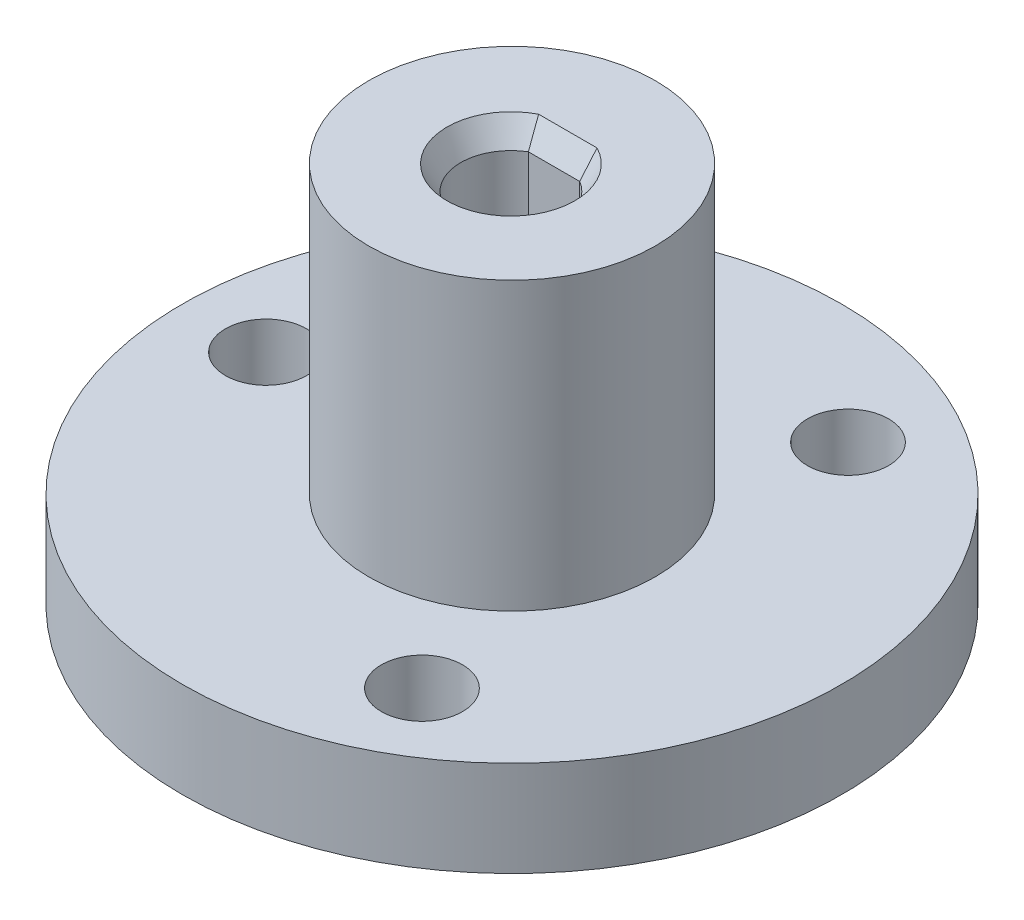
ISO-10303-21;
HEADER;
FILE_DESCRIPTION(('STEP AP214'),'2;1');
FILE_NAME('part.step','',(''),(''),'','','');
FILE_SCHEMA(('AUTOMOTIVE_DESIGN { 1 0 10303 214 1 1 1 1 }'));
ENDSEC;
DATA;
#1=APPLICATION_CONTEXT('core data for automotive mechanical design processes');
#2=APPLICATION_PROTOCOL_DEFINITION('international standard','automotive_design',2000,#1);
#3=PRODUCT_CONTEXT('',#1,'mechanical');
#4=PRODUCT('Part','Part','',(#3));
#5=PRODUCT_RELATED_PRODUCT_CATEGORY('part','',(#4));
#6=PRODUCT_DEFINITION_FORMATION('','',#4);
#7=PRODUCT_DEFINITION_CONTEXT('part definition',#1,'design');
#8=PRODUCT_DEFINITION('design','',#6,#7);
#9=PRODUCT_DEFINITION_SHAPE('','',#8);
#10=(LENGTH_UNIT() NAMED_UNIT(*) SI_UNIT(.MILLI.,.METRE.));
#11=(NAMED_UNIT(*) PLANE_ANGLE_UNIT() SI_UNIT($,.RADIAN.));
#12=(NAMED_UNIT(*) SI_UNIT($,.STERADIAN.) SOLID_ANGLE_UNIT());
#13=UNCERTAINTY_MEASURE_WITH_UNIT(LENGTH_MEASURE(1.E-05),#10,'distance_accuracy_value','');
#14=(GEOMETRIC_REPRESENTATION_CONTEXT(3) GLOBAL_UNCERTAINTY_ASSIGNED_CONTEXT((#13)) GLOBAL_UNIT_ASSIGNED_CONTEXT((#10,
#11,#12)) REPRESENTATION_CONTEXT('',''));
#15=CARTESIAN_POINT('',(0.,0.,0.));
#16=DIRECTION('',(0.,0.,1.));
#17=DIRECTION('',(1.,0.,0.));
#18=AXIS2_PLACEMENT_3D('',#15,#16,#17);
#19=CARTESIAN_POINT('',(-10.3,4.,0.));
#20=DIRECTION('',(0.,-1.,0.));
#21=DIRECTION('',(0.,0.,-1.));
#22=AXIS2_PLACEMENT_3D('',#19,#20,#21);
#23=CYLINDRICAL_SURFACE('',#22,1.7);
#24=CARTESIAN_POINT('',(-10.3,4.,0.));
#25=DIRECTION('',(0.,1.,0.));
#26=DIRECTION('',(0.,0.,1.));
#27=AXIS2_PLACEMENT_3D('',#24,#25,#26);
#28=CIRCLE('',#27,1.7);
#29=CARTESIAN_POINT('',(-10.3,4.,1.7));
#30=VERTEX_POINT('',#29);
#31=EDGE_CURVE('E118',#30,#30,#28,.T.);
#32=ORIENTED_EDGE('',*,*,#31,.T.);
#33=EDGE_LOOP('',(#32));
#34=FACE_BOUND('',#33,.T.);
#35=CARTESIAN_POINT('',(-10.3,0.,0.));
#36=DIRECTION('',(0.,1.,0.));
#37=DIRECTION('',(0.,0.,1.));
#38=AXIS2_PLACEMENT_3D('',#35,#36,#37);
#39=CIRCLE('',#38,1.7);
#40=CARTESIAN_POINT('',(-10.3,0.,1.7));
#41=VERTEX_POINT('',#40);
#42=EDGE_CURVE('E133',#41,#41,#39,.T.);
#43=ORIENTED_EDGE('',*,*,#42,.F.);
#44=EDGE_LOOP('',(#43));
#45=FACE_BOUND('',#44,.T.);
#46=ADVANCED_FACE('F45',(#34,#45),#23,.F.);
#47=CARTESIAN_POINT('',(5.15,4.,-8.92006165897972));
#48=DIRECTION('',(0.,-1.,0.));
#49=DIRECTION('',(0.,0.,-1.));
#50=AXIS2_PLACEMENT_3D('',#47,#48,#49);
#51=CYLINDRICAL_SURFACE('',#50,1.7);
#52=CARTESIAN_POINT('',(5.15,4.,-8.92006165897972));
#53=DIRECTION('',(0.,1.,0.));
#54=DIRECTION('',(0.,0.,1.));
#55=AXIS2_PLACEMENT_3D('',#52,#53,#54);
#56=CIRCLE('',#55,1.7);
#57=CARTESIAN_POINT('',(5.15,4.,-7.22006165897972));
#58=VERTEX_POINT('',#57);
#59=EDGE_CURVE('E114',#58,#58,#56,.T.);
#60=ORIENTED_EDGE('',*,*,#59,.T.);
#61=EDGE_LOOP('',(#60));
#62=FACE_BOUND('',#61,.T.);
#63=CARTESIAN_POINT('',(5.15,0.,-8.92006165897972));
#64=DIRECTION('',(0.,1.,0.));
#65=DIRECTION('',(0.,0.,1.));
#66=AXIS2_PLACEMENT_3D('',#63,#64,#65);
#67=CIRCLE('',#66,1.7);
#68=CARTESIAN_POINT('',(5.15,0.,-7.22006165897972));
#69=VERTEX_POINT('',#68);
#70=EDGE_CURVE('E130',#69,#69,#67,.T.);
#71=ORIENTED_EDGE('',*,*,#70,.F.);
#72=EDGE_LOOP('',(#71));
#73=FACE_BOUND('',#72,.T.);
#74=ADVANCED_FACE('F156',(#62,#73),#51,.F.);
#75=CARTESIAN_POINT('',(5.15000000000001,4.,8.92006165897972));
#76=DIRECTION('',(0.,-1.,0.));
#77=DIRECTION('',(0.,0.,-1.));
#78=AXIS2_PLACEMENT_3D('',#75,#76,#77);
#79=CYLINDRICAL_SURFACE('',#78,1.7);
#80=CARTESIAN_POINT('',(5.15000000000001,4.,8.92006165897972));
#81=DIRECTION('',(0.,1.,0.));
#82=DIRECTION('',(0.,0.,1.));
#83=AXIS2_PLACEMENT_3D('',#80,#81,#82);
#84=CIRCLE('',#83,1.7);
#85=CARTESIAN_POINT('',(5.15000000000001,4.,10.6200616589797));
#86=VERTEX_POINT('',#85);
#87=EDGE_CURVE('E111',#86,#86,#84,.T.);
#88=ORIENTED_EDGE('',*,*,#87,.T.);
#89=EDGE_LOOP('',(#88));
#90=FACE_BOUND('',#89,.T.);
#91=CARTESIAN_POINT('',(5.15000000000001,0.,8.92006165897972));
#92=DIRECTION('',(0.,1.,0.));
#93=DIRECTION('',(0.,0.,1.));
#94=AXIS2_PLACEMENT_3D('',#91,#92,#93);
#95=CIRCLE('',#94,1.7);
#96=CARTESIAN_POINT('',(5.15000000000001,0.,10.6200616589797));
#97=VERTEX_POINT('',#96);
#98=EDGE_CURVE('E97',#97,#97,#95,.T.);
#99=ORIENTED_EDGE('',*,*,#98,.F.);
#100=EDGE_LOOP('',(#99));
#101=FACE_BOUND('',#100,.T.);
#102=ADVANCED_FACE('F151',(#90,#101),#79,.F.);
#103=CARTESIAN_POINT('',(0.,4.,0.));
#104=DIRECTION('',(0.,-1.,0.));
#105=DIRECTION('',(0.,0.,-1.));
#106=AXIS2_PLACEMENT_3D('',#103,#104,#105);
#107=CYLINDRICAL_SURFACE('',#106,13.8);
#108=CARTESIAN_POINT('',(0.,4.,0.));
#109=DIRECTION('',(0.,1.,0.));
#110=DIRECTION('',(0.,0.,1.));
#111=AXIS2_PLACEMENT_3D('',#108,#109,#110);
#112=CIRCLE('',#111,13.8);
#113=CARTESIAN_POINT('',(0.,4.,13.8));
#114=VERTEX_POINT('',#113);
#115=EDGE_CURVE('E124',#114,#114,#112,.T.);
#116=ORIENTED_EDGE('',*,*,#115,.F.);
#117=EDGE_LOOP('',(#116));
#118=FACE_BOUND('',#117,.T.);
#119=CARTESIAN_POINT('',(0.,0.,0.));
#120=DIRECTION('',(0.,1.,0.));
#121=DIRECTION('',(0.,0.,1.));
#122=AXIS2_PLACEMENT_3D('',#119,#120,#121);
#123=CIRCLE('',#122,13.8);
#124=CARTESIAN_POINT('',(0.,0.,13.8));
#125=VERTEX_POINT('',#124);
#126=EDGE_CURVE('E115',#125,#125,#123,.T.);
#127=ORIENTED_EDGE('',*,*,#126,.T.);
#128=EDGE_LOOP('',(#127));
#129=FACE_BOUND('',#128,.T.);
#130=ADVANCED_FACE('F155',(#118,#129),#107,.T.);
#131=CARTESIAN_POINT('',(0.,4.,0.));
#132=DIRECTION('',(0.,1.,0.));
#133=DIRECTION('',(0.,0.,1.));
#134=AXIS2_PLACEMENT_3D('',#131,#132,#133);
#135=PLANE('',#134);
#136=ORIENTED_EDGE('',*,*,#87,.F.);
#137=EDGE_LOOP('',(#136));
#138=FACE_BOUND('',#137,.T.);
#139=ORIENTED_EDGE('',*,*,#59,.F.);
#140=EDGE_LOOP('',(#139));
#141=FACE_BOUND('',#140,.T.);
#142=ORIENTED_EDGE('',*,*,#31,.F.);
#143=EDGE_LOOP('',(#142));
#144=FACE_BOUND('',#143,.T.);
#145=CARTESIAN_POINT('',(0.,4.,0.));
#146=DIRECTION('',(0.,1.,0.));
#147=DIRECTION('',(0.,0.,1.));
#148=AXIS2_PLACEMENT_3D('',#145,#146,#147);
#149=CIRCLE('',#148,6.);
#150=CARTESIAN_POINT('',(0.,4.,6.));
#151=VERTEX_POINT('',#150);
#152=EDGE_CURVE('E121',#151,#151,#149,.T.);
#153=ORIENTED_EDGE('',*,*,#152,.F.);
#154=EDGE_LOOP('',(#153));
#155=FACE_BOUND('',#154,.T.);
#156=ORIENTED_EDGE('',*,*,#115,.T.);
#157=EDGE_LOOP('',(#156));
#158=FACE_BOUND('',#157,.T.);
#159=ADVANCED_FACE('F166',(#138,#141,#144,#155,#158),#135,.T.);
#160=CARTESIAN_POINT('',(0.,0.,0.));
#161=DIRECTION('',(0.,1.,0.));
#162=DIRECTION('',(0.,0.,1.));
#163=AXIS2_PLACEMENT_3D('',#160,#161,#162);
#164=PLANE('',#163);
#165=ORIENTED_EDGE('',*,*,#98,.T.);
#166=EDGE_LOOP('',(#165));
#167=FACE_BOUND('',#166,.T.);
#168=ORIENTED_EDGE('',*,*,#70,.T.);
#169=EDGE_LOOP('',(#168));
#170=FACE_BOUND('',#169,.T.);
#171=ORIENTED_EDGE('',*,*,#42,.T.);
#172=EDGE_LOOP('',(#171));
#173=FACE_BOUND('',#172,.T.);
#174=ORIENTED_EDGE('',*,*,#126,.F.);
#175=EDGE_LOOP('',(#174));
#176=FACE_BOUND('',#175,.T.);
#177=CARTESIAN_POINT('',(0.,0.,0.045));
#178=DIRECTION('',(0.,1.,0.));
#179=DIRECTION('',(0.,0.,1.));
#180=AXIS2_PLACEMENT_3D('',#177,#178,#179);
#181=CIRCLE('',#180,2.1);
#182=CARTESIAN_POINT('',(-1.07330098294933,0.,-1.76));
#183=VERTEX_POINT('',#182);
#184=CARTESIAN_POINT('',(1.07330098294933,0.,-1.76));
#185=VERTEX_POINT('',#184);
#186=EDGE_CURVE('E102',#183,#185,#181,.T.);
#187=ORIENTED_EDGE('',*,*,#186,.T.);
#188=DIRECTION('',(1.,0.,0.));
#189=VECTOR('',#188,1.);
#190=CARTESIAN_POINT('',(0.,0.,-1.76));
#191=LINE('',#190,#189);
#192=EDGE_CURVE('E91',#183,#185,#191,.T.);
#193=ORIENTED_EDGE('',*,*,#192,.F.);
#194=EDGE_LOOP('',(#187,#193));
#195=FACE_BOUND('',#194,.T.);
#196=ADVANCED_FACE('F101',(#167,#170,#173,#176,#195),#164,.F.);
#197=CARTESIAN_POINT('',(0.,16.,0.045));
#198=DIRECTION('',(0.,-1.,0.));
#199=DIRECTION('',(0.,0.,-1.));
#200=AXIS2_PLACEMENT_3D('',#197,#198,#199);
#201=CYLINDRICAL_SURFACE('',#200,2.1);
#202=DIRECTION('',(0.,-1.,0.));
#203=VECTOR('',#202,1.);
#204=CARTESIAN_POINT('',(-1.07330098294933,16.,-1.76));
#205=LINE('',#204,#203);
#206=CARTESIAN_POINT('',(-1.07330098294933,15.,-1.76));
#207=VERTEX_POINT('',#206);
#208=EDGE_CURVE('E87',#207,#183,#205,.T.);
#209=ORIENTED_EDGE('',*,*,#208,.F.);
#210=CARTESIAN_POINT('',(0.,15.,0.045));
#211=DIRECTION('',(0.,1.,0.));
#212=DIRECTION('',(0.,0.,1.));
#213=AXIS2_PLACEMENT_3D('',#210,#211,#212);
#214=CIRCLE('',#213,2.1);
#215=CARTESIAN_POINT('',(1.07330098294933,15.,-1.76));
#216=VERTEX_POINT('',#215);
#217=EDGE_CURVE('E127',#207,#216,#214,.T.);
#218=ORIENTED_EDGE('',*,*,#217,.T.);
#219=DIRECTION('',(0.,-1.,0.));
#220=VECTOR('',#219,1.);
#221=CARTESIAN_POINT('',(1.07330098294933,16.,-1.76));
#222=LINE('',#221,#220);
#223=EDGE_CURVE('E98',#216,#185,#222,.T.);
#224=ORIENTED_EDGE('',*,*,#223,.T.);
#225=ORIENTED_EDGE('',*,*,#186,.F.);
#226=EDGE_LOOP('',(#209,#218,#224,#225));
#227=FACE_BOUND('',#226,.T.);
#228=ADVANCED_FACE('F105',(#227),#201,.F.);
#229=CARTESIAN_POINT('',(0.,16.,-1.76));
#230=DIRECTION('',(0.,0.,-1.));
#231=DIRECTION('',(-1.,0.,0.));
#232=AXIS2_PLACEMENT_3D('',#229,#230,#231);
#233=PLANE('',#232);
#234=ORIENTED_EDGE('',*,*,#223,.F.);
#235=DIRECTION('',(-1.,0.,0.));
#236=VECTOR('',#235,1.);
#237=CARTESIAN_POINT('',(-1.07330098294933,15.,-1.76));
#238=LINE('',#237,#236);
#239=EDGE_CURVE('E11',#216,#207,#238,.T.);
#240=ORIENTED_EDGE('',*,*,#239,.T.);
#241=ORIENTED_EDGE('',*,*,#208,.T.);
#242=ORIENTED_EDGE('',*,*,#192,.T.);
#243=EDGE_LOOP('',(#234,#240,#241,#242));
#244=FACE_BOUND('',#243,.T.);
#245=ADVANCED_FACE('F90',(#244),#233,.F.);
#246=CARTESIAN_POINT('',(0.,16.,0.));
#247=DIRECTION('',(0.,-1.,0.));
#248=DIRECTION('',(0.,0.,-1.));
#249=AXIS2_PLACEMENT_3D('',#246,#247,#248);
#250=CYLINDRICAL_SURFACE('',#249,6.);
#251=ORIENTED_EDGE('',*,*,#152,.T.);
#252=EDGE_LOOP('',(#251));
#253=FACE_BOUND('',#252,.T.);
#254=CARTESIAN_POINT('',(0.,16.,0.));
#255=DIRECTION('',(0.,1.,0.));
#256=DIRECTION('',(0.,0.,1.));
#257=AXIS2_PLACEMENT_3D('',#254,#255,#256);
#258=CIRCLE('',#257,6.);
#259=CARTESIAN_POINT('',(0.,16.,6.));
#260=VERTEX_POINT('',#259);
#261=EDGE_CURVE('E103',#260,#260,#258,.T.);
#262=ORIENTED_EDGE('',*,*,#261,.F.);
#263=EDGE_LOOP('',(#262));
#264=FACE_BOUND('',#263,.T.);
#265=ADVANCED_FACE('F178',(#253,#264),#250,.T.);
#266=CARTESIAN_POINT('',(0.,16.,0.));
#267=DIRECTION('',(0.,1.,0.));
#268=DIRECTION('',(0.,0.,1.));
#269=AXIS2_PLACEMENT_3D('',#266,#267,#268);
#270=PLANE('',#269);
#271=DIRECTION('',(1.,0.,0.));
#272=VECTOR('',#271,1.);
#273=CARTESIAN_POINT('',(1.07330098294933,16.,-2.33735026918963));
#274=LINE('',#273,#272);
#275=CARTESIAN_POINT('',(-1.22172487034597,16.,-2.33735026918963));
#276=VERTEX_POINT('',#275);
#277=CARTESIAN_POINT('',(1.22172487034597,16.,-2.33735026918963));
#278=VERTEX_POINT('',#277);
#279=EDGE_CURVE('E67',#276,#278,#274,.T.);
#280=ORIENTED_EDGE('',*,*,#279,.T.);
#281=CARTESIAN_POINT('',(0.,16.,0.045));
#282=DIRECTION('',(0.,1.,0.));
#283=DIRECTION('',(0.,0.,1.));
#284=AXIS2_PLACEMENT_3D('',#281,#282,#283);
#285=CIRCLE('',#284,2.67735026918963);
#286=EDGE_CURVE('E60',#278,#276,#285,.F.);
#287=ORIENTED_EDGE('',*,*,#286,.T.);
#288=EDGE_LOOP('',(#280,#287));
#289=FACE_BOUND('',#288,.T.);
#290=ORIENTED_EDGE('',*,*,#261,.T.);
#291=EDGE_LOOP('',(#290));
#292=FACE_BOUND('',#291,.T.);
#293=ADVANCED_FACE('F181',(#289,#292),#270,.T.);
#294=CARTESIAN_POINT('',(0.,16.,-2.33735026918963));
#295=DIRECTION('',(0.,0.499999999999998,0.86602540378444));
#296=DIRECTION('',(-1.,0.,0.));
#297=AXIS2_PLACEMENT_3D('',#294,#295,#296);
#298=PLANE('',#297);
#299=CARTESIAN_POINT('',(1.07330098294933,15.,-1.76));
#300=CARTESIAN_POINT('',(1.08650853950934,15.0832387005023,-1.80805788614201));
#301=CARTESIAN_POINT('',(1.09947933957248,15.1665053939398,-1.85613193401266));
#302=CARTESIAN_POINT('',(1.12498890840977,15.3330870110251,-1.95230787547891));
#303=CARTESIAN_POINT('',(1.13752768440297,15.4164019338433,-2.00040976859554));
#304=CARTESIAN_POINT('',(1.16221506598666,15.5830746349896,-2.09663829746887));
#305=CARTESIAN_POINT('',(1.1743636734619,15.6664324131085,-2.14476493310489));
#306=CARTESIAN_POINT('',(1.19830387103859,15.8331878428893,-2.24104122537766));
#307=CARTESIAN_POINT('',(1.21009545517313,15.9165854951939,-2.28919088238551));
#308=CARTESIAN_POINT('',(1.22172487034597,16.,-2.33735026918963));
#309=B_SPLINE_CURVE_WITH_KNOTS('',3,(#299,#300,#301,#302,#303,#304,#305,#306,#307,#308),
.UNSPECIFIED.,.F.,.F.,(4,2,2,2,4),(0.,0.291056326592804,0.58210778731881,0.873157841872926,
1.16421275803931),.UNSPECIFIED.);
#310=EDGE_CURVE('E107',#278,#216,#309,.F.);
#311=ORIENTED_EDGE('',*,*,#310,.F.);
#312=ORIENTED_EDGE('',*,*,#279,.F.);
#313=CARTESIAN_POINT('',(-1.22172487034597,16.,-2.33735026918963));
#314=CARTESIAN_POINT('',(-1.21009545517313,15.9165854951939,-2.28919088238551));
#315=CARTESIAN_POINT('',(-1.19830387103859,15.8331878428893,-2.24104122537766));
#316=CARTESIAN_POINT('',(-1.17436367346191,15.6664324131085,-2.14476493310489));
#317=CARTESIAN_POINT('',(-1.16221506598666,15.5830746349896,-2.09663829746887));
#318=CARTESIAN_POINT('',(-1.13752768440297,15.4164019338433,-2.00040976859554));
#319=CARTESIAN_POINT('',(-1.12498890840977,15.3330870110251,-1.95230787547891));
#320=CARTESIAN_POINT('',(-1.09947933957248,15.1665053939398,-1.85613193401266));
#321=CARTESIAN_POINT('',(-1.08650853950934,15.0832387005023,-1.80805788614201));
#322=CARTESIAN_POINT('',(-1.07330098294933,15.,-1.76));
#323=B_SPLINE_CURVE_WITH_KNOTS('',3,(#313,#314,#315,#316,#317,#318,#319,#320,#321,#322),
.UNSPECIFIED.,.F.,.F.,(4,2,2,2,4),(0.,0.291054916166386,0.582104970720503,0.873156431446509,
1.16421275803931),.UNSPECIFIED.);
#324=EDGE_CURVE('E51',#207,#276,#323,.F.);
#325=ORIENTED_EDGE('',*,*,#324,.F.);
#326=ORIENTED_EDGE('',*,*,#239,.F.);
#327=EDGE_LOOP('',(#311,#312,#325,#326));
#328=FACE_BOUND('',#327,.T.);
#329=ADVANCED_FACE('F48',(#328),#298,.T.);
#330=CARTESIAN_POINT('',(0.,15.,0.045));
#331=DIRECTION('',(0.,1.,0.));
#332=DIRECTION('',(0.,0.,1.));
#333=AXIS2_PLACEMENT_3D('',#330,#331,#332);
#334=CONICAL_SURFACE('',#333,2.1,0.523598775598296);
#335=ORIENTED_EDGE('',*,*,#324,.T.);
#336=ORIENTED_EDGE('',*,*,#286,.F.);
#337=ORIENTED_EDGE('',*,*,#310,.T.);
#338=ORIENTED_EDGE('',*,*,#217,.F.);
#339=EDGE_LOOP('',(#335,#336,#337,#338));
#340=FACE_BOUND('',#339,.T.);
#341=ADVANCED_FACE('F145',(#340),#334,.F.);
#342=CLOSED_SHELL('',(#46,#74,#102,#130,#159,#196,#228,#245,#265,#293,#329,#341));
#343=MANIFOLD_SOLID_BREP('B2',#342);
#344=ADVANCED_BREP_SHAPE_REPRESENTATION('',(#18,#343),#14);
#345=SHAPE_DEFINITION_REPRESENTATION(#9,#344);
ENDSEC;
END-ISO-10303-21;
